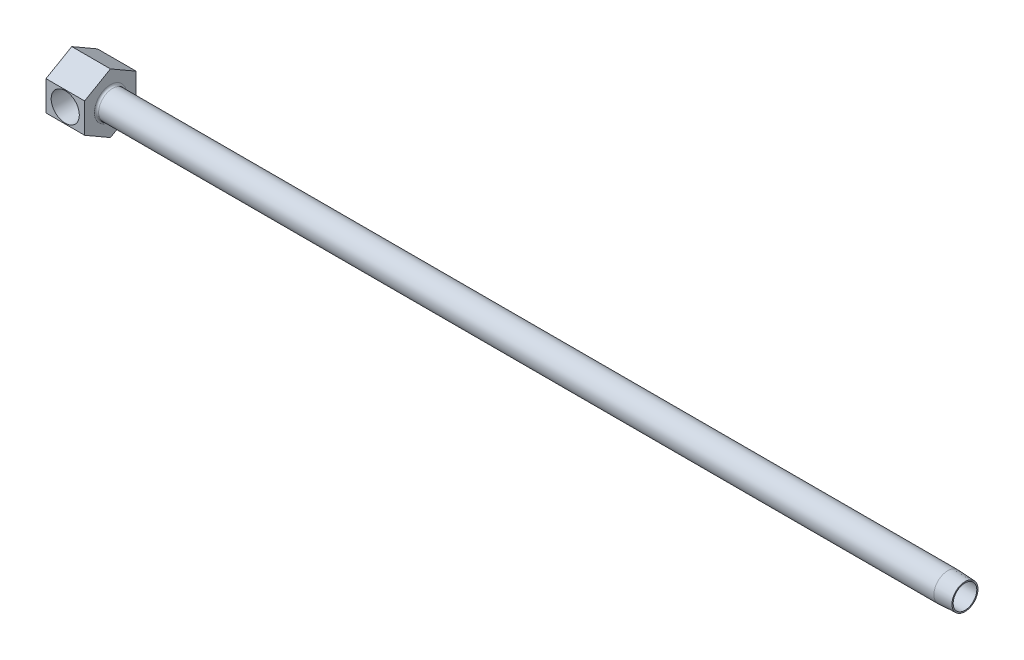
ISO-10303-21;
HEADER;
FILE_DESCRIPTION(('STEP AP214'),'2;1');
FILE_NAME('part.step','',(''),(''),'','','');
FILE_SCHEMA(('AUTOMOTIVE_DESIGN { 1 0 10303 214 1 1 1 1 }'));
ENDSEC;
DATA;
#1=APPLICATION_CONTEXT('core data for automotive mechanical design processes');
#2=APPLICATION_PROTOCOL_DEFINITION('international standard','automotive_design',2000,#1);
#3=PRODUCT_CONTEXT('',#1,'mechanical');
#4=PRODUCT('Part','Part','',(#3));
#5=PRODUCT_RELATED_PRODUCT_CATEGORY('part','',(#4));
#6=PRODUCT_DEFINITION_FORMATION('','',#4);
#7=PRODUCT_DEFINITION_CONTEXT('part definition',#1,'design');
#8=PRODUCT_DEFINITION('design','',#6,#7);
#9=PRODUCT_DEFINITION_SHAPE('','',#8);
#10=(LENGTH_UNIT() NAMED_UNIT(*) SI_UNIT(.MILLI.,.METRE.));
#11=(NAMED_UNIT(*) PLANE_ANGLE_UNIT() SI_UNIT($,.RADIAN.));
#12=(NAMED_UNIT(*) SI_UNIT($,.STERADIAN.) SOLID_ANGLE_UNIT());
#13=UNCERTAINTY_MEASURE_WITH_UNIT(LENGTH_MEASURE(1.E-05),#10,'distance_accuracy_value','');
#14=(GEOMETRIC_REPRESENTATION_CONTEXT(3) GLOBAL_UNCERTAINTY_ASSIGNED_CONTEXT((#13)) GLOBAL_UNIT_ASSIGNED_CONTEXT((#10,
#11,#12)) REPRESENTATION_CONTEXT('',''));
#15=CARTESIAN_POINT('',(0.,0.,0.));
#16=DIRECTION('',(0.,0.,1.));
#17=DIRECTION('',(1.,0.,0.));
#18=AXIS2_PLACEMENT_3D('',#15,#16,#17);
#19=CARTESIAN_POINT('',(7.14375,0.,9.525));
#20=DIRECTION('',(1.,0.,0.));
#21=DIRECTION('',(0.,0.,-1.));
#22=AXIS2_PLACEMENT_3D('',#19,#20,#21);
#23=PLANE('',#22);
#24=DIRECTION('',(0.,0.,1.));
#25=VECTOR('',#24,1.);
#26=CARTESIAN_POINT('',(7.14375,4.21628045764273,19.05));
#27=LINE('',#26,#25);
#28=CARTESIAN_POINT('',(7.14375,4.21628045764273,8.39289543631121));
#29=VERTEX_POINT('',#28);
#30=CARTESIAN_POINT('',(7.14375,4.21628045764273,10.16));
#31=VERTEX_POINT('',#30);
#32=EDGE_CURVE('E280',#29,#31,#27,.T.);
#33=ORIENTED_EDGE('',*,*,#32,.F.);
#34=CARTESIAN_POINT('',(7.14375,0.,9.525));
#35=DIRECTION('',(1.,0.,0.));
#36=DIRECTION('',(0.,0.,-1.));
#37=AXIS2_PLACEMENT_3D('',#34,#35,#36);
#38=CIRCLE('',#37,4.365625);
#39=CARTESIAN_POINT('',(7.14375,4.31919629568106,10.16));
#40=VERTEX_POINT('',#39);
#41=EDGE_CURVE('E163',#29,#40,#38,.T.);
#42=ORIENTED_EDGE('',*,*,#41,.T.);
#43=DIRECTION('',(0.,1.,0.));
#44=VECTOR('',#43,1.);
#45=CARTESIAN_POINT('',(7.14375,0.,10.16));
#46=LINE('',#45,#44);
#47=EDGE_CURVE('E153',#31,#40,#46,.T.);
#48=ORIENTED_EDGE('',*,*,#47,.F.);
#49=EDGE_LOOP('',(#33,#42,#48));
#50=FACE_BOUND('',#49,.T.);
#51=ADVANCED_FACE('F15',(#50),#23,.T.);
#52=CARTESIAN_POINT('',(14.2875,5.4992613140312,19.05));
#53=DIRECTION('',(0.,0.,-1.));
#54=DIRECTION('',(-1.,0.,0.));
#55=AXIS2_PLACEMENT_3D('',#52,#53,#54);
#56=PLANE('',#55);
#57=CARTESIAN_POINT('',(7.112,0.,19.05));
#58=DIRECTION('',(0.,0.,1.));
#59=DIRECTION('',(1.,0.,0.));
#60=AXIS2_PLACEMENT_3D('',#57,#58,#59);
#61=CIRCLE('',#60,5.2023645);
#62=CARTESIAN_POINT('',(12.3143645,0.,19.05));
#63=VERTEX_POINT('',#62);
#64=EDGE_CURVE('E269',#63,#63,#61,.T.);
#65=ORIENTED_EDGE('',*,*,#64,.F.);
#66=EDGE_LOOP('',(#65));
#67=FACE_BOUND('',#66,.T.);
#68=DIRECTION('',(0.,-1.,0.));
#69=VECTOR('',#68,1.);
#70=CARTESIAN_POINT('',(0.,5.4992613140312,19.05));
#71=LINE('',#70,#69);
#72=CARTESIAN_POINT('',(0.,5.4992613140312,19.05));
#73=VERTEX_POINT('',#72);
#74=CARTESIAN_POINT('',(0.,-5.49926131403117,19.05));
#75=VERTEX_POINT('',#74);
#76=EDGE_CURVE('E178',#73,#75,#71,.T.);
#77=ORIENTED_EDGE('',*,*,#76,.T.);
#78=DIRECTION('',(-1.,0.,0.));
#79=VECTOR('',#78,1.);
#80=CARTESIAN_POINT('',(14.2875,-5.49926131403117,19.05));
#81=LINE('',#80,#79);
#82=CARTESIAN_POINT('',(14.2875,-5.49926131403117,19.05));
#83=VERTEX_POINT('',#82);
#84=EDGE_CURVE('E201',#83,#75,#81,.T.);
#85=ORIENTED_EDGE('',*,*,#84,.F.);
#86=DIRECTION('',(0.,-1.,0.));
#87=VECTOR('',#86,1.);
#88=CARTESIAN_POINT('',(14.2875,5.4992613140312,19.05));
#89=LINE('',#88,#87);
#90=CARTESIAN_POINT('',(14.2875,5.4992613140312,19.05));
#91=VERTEX_POINT('',#90);
#92=EDGE_CURVE('E194',#91,#83,#89,.T.);
#93=ORIENTED_EDGE('',*,*,#92,.F.);
#94=DIRECTION('',(-1.,0.,0.));
#95=VECTOR('',#94,1.);
#96=CARTESIAN_POINT('',(14.2875,5.4992613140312,19.05));
#97=LINE('',#96,#95);
#98=EDGE_CURVE('E204',#91,#73,#97,.T.);
#99=ORIENTED_EDGE('',*,*,#98,.T.);
#100=EDGE_LOOP('',(#77,#85,#93,#99));
#101=FACE_BOUND('',#100,.T.);
#102=ADVANCED_FACE('F119',(#67,#101),#56,.F.);
#103=CARTESIAN_POINT('',(14.2875,-5.49926131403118,0.));
#104=DIRECTION('',(1.,0.,0.));
#105=DIRECTION('',(0.,1.,0.));
#106=AXIS2_PLACEMENT_3D('',#103,#104,#105);
#107=PLANE('',#106);
#108=CARTESIAN_POINT('',(14.2875,0.,9.525));
#109=DIRECTION('',(1.,0.,0.));
#110=DIRECTION('',(0.,1.,0.));
#111=AXIS2_PLACEMENT_3D('',#108,#109,#110);
#112=CIRCLE('',#111,5.9309);
#113=CARTESIAN_POINT('',(14.2875,5.9309,9.525));
#114=VERTEX_POINT('',#113);
#115=EDGE_CURVE('E216',#114,#114,#112,.F.);
#116=ORIENTED_EDGE('',*,*,#115,.T.);
#117=EDGE_LOOP('',(#116));
#118=FACE_BOUND('',#117,.T.);
#119=DIRECTION('',(0.,0.5,-0.866025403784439));
#120=VECTOR('',#119,1.);
#121=CARTESIAN_POINT('',(14.2875,-10.9985226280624,9.525));
#122=LINE('',#121,#120);
#123=CARTESIAN_POINT('',(14.2875,-10.9985226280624,9.525));
#124=VERTEX_POINT('',#123);
#125=CARTESIAN_POINT('',(14.2875,-5.49926131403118,0.));
#126=VERTEX_POINT('',#125);
#127=EDGE_CURVE('E184',#124,#126,#122,.T.);
#128=ORIENTED_EDGE('',*,*,#127,.T.);
#129=DIRECTION('',(0.,1.,0.));
#130=VECTOR('',#129,1.);
#131=CARTESIAN_POINT('',(14.2875,-5.49926131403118,0.));
#132=LINE('',#131,#130);
#133=CARTESIAN_POINT('',(14.2875,5.49926131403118,0.));
#134=VERTEX_POINT('',#133);
#135=EDGE_CURVE('E188',#126,#134,#132,.T.);
#136=ORIENTED_EDGE('',*,*,#135,.T.);
#137=DIRECTION('',(0.,0.5,0.866025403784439));
#138=VECTOR('',#137,1.);
#139=CARTESIAN_POINT('',(14.2875,5.49926131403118,0.));
#140=LINE('',#139,#138);
#141=CARTESIAN_POINT('',(14.2875,10.9985226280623,9.525));
#142=VERTEX_POINT('',#141);
#143=EDGE_CURVE('E190',#134,#142,#140,.T.);
#144=ORIENTED_EDGE('',*,*,#143,.T.);
#145=DIRECTION('',(0.,-0.5,0.86602540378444));
#146=VECTOR('',#145,1.);
#147=CARTESIAN_POINT('',(14.2875,10.9985226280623,9.525));
#148=LINE('',#147,#146);
#149=EDGE_CURVE('E192',#142,#91,#148,.T.);
#150=ORIENTED_EDGE('',*,*,#149,.T.);
#151=ORIENTED_EDGE('',*,*,#92,.T.);
#152=DIRECTION('',(0.,-0.5,-0.866025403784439));
#153=VECTOR('',#152,1.);
#154=CARTESIAN_POINT('',(14.2875,-5.49926131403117,19.05));
#155=LINE('',#154,#153);
#156=EDGE_CURVE('E38',#83,#124,#155,.T.);
#157=ORIENTED_EDGE('',*,*,#156,.T.);
#158=EDGE_LOOP('',(#128,#136,#144,#150,#151,#157));
#159=FACE_BOUND('',#158,.T.);
#160=ADVANCED_FACE('F127',(#118,#159),#107,.T.);
#161=CARTESIAN_POINT('',(14.2875,-10.9985226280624,9.525));
#162=DIRECTION('',(0.,0.866025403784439,0.5));
#163=DIRECTION('',(0.,-0.5,0.866025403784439));
#164=AXIS2_PLACEMENT_3D('',#161,#162,#163);
#165=PLANE('',#164);
#166=DIRECTION('',(0.,0.5,-0.866025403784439));
#167=VECTOR('',#166,1.);
#168=CARTESIAN_POINT('',(0.,-10.9985226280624,9.525));
#169=LINE('',#168,#167);
#170=CARTESIAN_POINT('',(0.,-10.9985226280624,9.525));
#171=VERTEX_POINT('',#170);
#172=CARTESIAN_POINT('',(0.,-5.49926131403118,0.));
#173=VERTEX_POINT('',#172);
#174=EDGE_CURVE('E166',#171,#173,#169,.T.);
#175=ORIENTED_EDGE('',*,*,#174,.T.);
#176=DIRECTION('',(-1.,0.,0.));
#177=VECTOR('',#176,1.);
#178=CARTESIAN_POINT('',(14.2875,-5.49926131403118,0.));
#179=LINE('',#178,#177);
#180=EDGE_CURVE('E213',#126,#173,#179,.T.);
#181=ORIENTED_EDGE('',*,*,#180,.F.);
#182=ORIENTED_EDGE('',*,*,#127,.F.);
#183=DIRECTION('',(-1.,0.,0.));
#184=VECTOR('',#183,1.);
#185=CARTESIAN_POINT('',(14.2875,-10.9985226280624,9.525));
#186=LINE('',#185,#184);
#187=EDGE_CURVE('E197',#124,#171,#186,.T.);
#188=ORIENTED_EDGE('',*,*,#187,.T.);
#189=EDGE_LOOP('',(#175,#181,#182,#188));
#190=FACE_BOUND('',#189,.T.);
#191=ADVANCED_FACE('F301',(#190),#165,.F.);
#192=CARTESIAN_POINT('',(14.2875,-5.49926131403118,0.));
#193=DIRECTION('',(0.,0.,1.));
#194=DIRECTION('',(0.,-1.,0.));
#195=AXIS2_PLACEMENT_3D('',#192,#193,#194);
#196=PLANE('',#195);
#197=DIRECTION('',(0.,1.,0.));
#198=VECTOR('',#197,1.);
#199=CARTESIAN_POINT('',(0.,-5.49926131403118,0.));
#200=LINE('',#199,#198);
#201=CARTESIAN_POINT('',(0.,5.49926131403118,0.));
#202=VERTEX_POINT('',#201);
#203=EDGE_CURVE('E169',#173,#202,#200,.T.);
#204=ORIENTED_EDGE('',*,*,#203,.T.);
#205=DIRECTION('',(-1.,0.,0.));
#206=VECTOR('',#205,1.);
#207=CARTESIAN_POINT('',(14.2875,5.49926131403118,0.));
#208=LINE('',#207,#206);
#209=EDGE_CURVE('E210',#134,#202,#208,.T.);
#210=ORIENTED_EDGE('',*,*,#209,.F.);
#211=ORIENTED_EDGE('',*,*,#135,.F.);
#212=ORIENTED_EDGE('',*,*,#180,.T.);
#213=EDGE_LOOP('',(#204,#210,#211,#212));
#214=FACE_BOUND('',#213,.T.);
#215=ADVANCED_FACE('F307',(#214),#196,.F.);
#216=CARTESIAN_POINT('',(14.2875,5.49926131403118,0.));
#217=DIRECTION('',(0.,-0.866025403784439,0.5));
#218=DIRECTION('',(0.,-0.5,-0.866025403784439));
#219=AXIS2_PLACEMENT_3D('',#216,#217,#218);
#220=PLANE('',#219);
#221=DIRECTION('',(0.,0.5,0.866025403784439));
#222=VECTOR('',#221,1.);
#223=CARTESIAN_POINT('',(0.,5.49926131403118,0.));
#224=LINE('',#223,#222);
#225=CARTESIAN_POINT('',(0.,10.9985226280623,9.525));
#226=VERTEX_POINT('',#225);
#227=EDGE_CURVE('E172',#202,#226,#224,.T.);
#228=ORIENTED_EDGE('',*,*,#227,.T.);
#229=DIRECTION('',(-1.,0.,0.));
#230=VECTOR('',#229,1.);
#231=CARTESIAN_POINT('',(14.2875,10.9985226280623,9.525));
#232=LINE('',#231,#230);
#233=EDGE_CURVE('E207',#142,#226,#232,.T.);
#234=ORIENTED_EDGE('',*,*,#233,.F.);
#235=ORIENTED_EDGE('',*,*,#143,.F.);
#236=ORIENTED_EDGE('',*,*,#209,.T.);
#237=EDGE_LOOP('',(#228,#234,#235,#236));
#238=FACE_BOUND('',#237,.T.);
#239=ADVANCED_FACE('F309',(#238),#220,.F.);
#240=CARTESIAN_POINT('',(14.2875,10.9985226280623,9.525));
#241=DIRECTION('',(0.,-0.86602540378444,-0.5));
#242=DIRECTION('',(0.,0.5,-0.86602540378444));
#243=AXIS2_PLACEMENT_3D('',#240,#241,#242);
#244=PLANE('',#243);
#245=DIRECTION('',(0.,-0.5,0.86602540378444));
#246=VECTOR('',#245,1.);
#247=CARTESIAN_POINT('',(0.,10.9985226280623,9.525));
#248=LINE('',#247,#246);
#249=EDGE_CURVE('E175',#226,#73,#248,.T.);
#250=ORIENTED_EDGE('',*,*,#249,.T.);
#251=ORIENTED_EDGE('',*,*,#98,.F.);
#252=ORIENTED_EDGE('',*,*,#149,.F.);
#253=ORIENTED_EDGE('',*,*,#233,.T.);
#254=EDGE_LOOP('',(#250,#251,#252,#253));
#255=FACE_BOUND('',#254,.T.);
#256=ADVANCED_FACE('F312',(#255),#244,.F.);
#257=CARTESIAN_POINT('',(14.2875,-5.49926131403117,19.05));
#258=DIRECTION('',(0.,0.866025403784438,-0.5));
#259=DIRECTION('',(0.,0.5,0.866025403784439));
#260=AXIS2_PLACEMENT_3D('',#257,#258,#259);
#261=PLANE('',#260);
#262=DIRECTION('',(0.,-0.5,-0.866025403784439));
#263=VECTOR('',#262,1.);
#264=CARTESIAN_POINT('',(0.,-5.49926131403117,19.05));
#265=LINE('',#264,#263);
#266=EDGE_CURVE('E181',#75,#171,#265,.T.);
#267=ORIENTED_EDGE('',*,*,#266,.T.);
#268=ORIENTED_EDGE('',*,*,#187,.F.);
#269=ORIENTED_EDGE('',*,*,#156,.F.);
#270=ORIENTED_EDGE('',*,*,#84,.T.);
#271=EDGE_LOOP('',(#267,#268,#269,#270));
#272=FACE_BOUND('',#271,.T.);
#273=ADVANCED_FACE('F296',(#272),#261,.F.);
#274=CARTESIAN_POINT('',(0.,-5.49926131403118,0.));
#275=DIRECTION('',(1.,0.,0.));
#276=DIRECTION('',(0.,1.,0.));
#277=AXIS2_PLACEMENT_3D('',#274,#275,#276);
#278=PLANE('',#277);
#279=ORIENTED_EDGE('',*,*,#174,.F.);
#280=ORIENTED_EDGE('',*,*,#266,.F.);
#281=ORIENTED_EDGE('',*,*,#76,.F.);
#282=ORIENTED_EDGE('',*,*,#249,.F.);
#283=ORIENTED_EDGE('',*,*,#227,.F.);
#284=ORIENTED_EDGE('',*,*,#203,.F.);
#285=EDGE_LOOP('',(#279,#280,#281,#282,#283,#284));
#286=FACE_BOUND('',#285,.T.);
#287=ADVANCED_FACE('F141',(#286),#278,.F.);
#288=CARTESIAN_POINT('',(68.0114010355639,0.,9.525));
#289=DIRECTION('',(-1.,0.,0.));
#290=DIRECTION('',(0.,0.,1.));
#291=AXIS2_PLACEMENT_3D('',#288,#289,#290);
#292=CYLINDRICAL_SURFACE('',#291,5.1435);
#293=CARTESIAN_POINT('',(323.85,0.,9.525));
#294=DIRECTION('',(-1.,0.,0.));
#295=DIRECTION('',(0.,0.,1.));
#296=AXIS2_PLACEMENT_3D('',#293,#294,#295);
#297=CIRCLE('',#296,5.1435);
#298=CARTESIAN_POINT('',(323.85,0.,14.6685));
#299=VERTEX_POINT('',#298);
#300=EDGE_CURVE('E10',#299,#299,#297,.F.);
#301=ORIENTED_EDGE('',*,*,#300,.F.);
#302=EDGE_LOOP('',(#301));
#303=FACE_BOUND('',#302,.T.);
#304=CARTESIAN_POINT('',(15.0749,0.,9.525));
#305=DIRECTION('',(1.,0.,0.));
#306=DIRECTION('',(0.,1.,0.));
#307=AXIS2_PLACEMENT_3D('',#304,#305,#306);
#308=CIRCLE('',#307,5.1435);
#309=CARTESIAN_POINT('',(15.0749,5.1435,9.525));
#310=VERTEX_POINT('',#309);
#311=EDGE_CURVE('E219',#310,#310,#308,.T.);
#312=ORIENTED_EDGE('',*,*,#311,.T.);
#313=EDGE_LOOP('',(#312));
#314=FACE_BOUND('',#313,.T.);
#315=ADVANCED_FACE('F17',(#303,#314),#292,.T.);
#316=CARTESIAN_POINT('',(7.14375,-4.31919629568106,10.16));
#317=VERTEX_POINT('',#316);
#318=CARTESIAN_POINT('',(7.14375,-4.21628045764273,10.16));
#319=VERTEX_POINT('',#318);
#320=EDGE_CURVE('E146',#317,#319,#46,.T.);
#321=ORIENTED_EDGE('',*,*,#320,.F.);
#322=CARTESIAN_POINT('',(7.14375,-4.21628045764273,8.39289543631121));
#323=VERTEX_POINT('',#322);
#324=EDGE_CURVE('E148',#317,#323,#38,.T.);
#325=ORIENTED_EDGE('',*,*,#324,.T.);
#326=DIRECTION('',(0.,0.,1.));
#327=VECTOR('',#326,1.);
#328=CARTESIAN_POINT('',(7.14375,-4.21628045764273,19.05));
#329=LINE('',#328,#327);
#330=EDGE_CURVE('E149',#319,#323,#329,.F.);
#331=ORIENTED_EDGE('',*,*,#330,.F.);
#332=EDGE_LOOP('',(#321,#325,#331));
#333=FACE_BOUND('',#332,.T.);
#334=ADVANCED_FACE('F122',(#333),#23,.T.);
#335=CARTESIAN_POINT('',(66.1375087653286,0.,9.525));
#336=DIRECTION('',(1.,0.,0.));
#337=DIRECTION('',(0.,0.,-1.));
#338=AXIS2_PLACEMENT_3D('',#335,#336,#337);
#339=CYLINDRICAL_SURFACE('',#338,4.365625);
#340=DIRECTION('',(1.,0.,0.));
#341=VECTOR('',#340,1.);
#342=CARTESIAN_POINT('',(66.1375087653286,4.31919629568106,10.16));
#343=LINE('',#342,#341);
#344=CARTESIAN_POINT('',(9.50166012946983,4.31919629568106,10.16));
#345=VERTEX_POINT('',#344);
#346=EDGE_CURVE('E23',#40,#345,#343,.T.);
#347=ORIENTED_EDGE('',*,*,#346,.F.);
#348=ORIENTED_EDGE('',*,*,#41,.F.);
#349=CARTESIAN_POINT('',(11.0152606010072,1.5945487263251,5.461));
#350=CARTESIAN_POINT('',(10.9690910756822,1.7075595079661,5.50534166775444));
#351=CARTESIAN_POINT('',(10.9186455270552,1.81703423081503,5.55373339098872));
#352=CARTESIAN_POINT('',(10.810302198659,2.02846645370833,5.65746242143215));
#353=CARTESIAN_POINT('',(10.7524192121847,2.13043826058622,5.71278593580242));
#354=CARTESIAN_POINT('',(10.5698905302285,2.42358040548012,5.88682744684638));
#355=CARTESIAN_POINT('',(10.4356317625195,2.6037024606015,6.01432367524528));
#356=CARTESIAN_POINT('',(10.2004726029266,2.87382153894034,6.2358690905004));
#357=CARTESIAN_POINT('',(10.1051285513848,2.97281573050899,6.32528321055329));
#358=CARTESIAN_POINT('',(9.90783434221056,3.15907014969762,6.50903483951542));
#359=CARTESIAN_POINT('',(9.80588273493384,3.2463277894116,6.60337342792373));
#360=CARTESIAN_POINT('',(9.59613587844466,3.40951469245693,6.79556583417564));
#361=CARTESIAN_POINT('',(9.48833347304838,3.48542963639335,6.89342390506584));
#362=CARTESIAN_POINT('',(9.26745878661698,3.62617881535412,7.09103053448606));
#363=CARTESIAN_POINT('',(9.15438825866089,3.69101670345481,7.19077845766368));
#364=CARTESIAN_POINT('',(8.91700112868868,3.81296593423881,7.39547820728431));
#365=CARTESIAN_POINT('',(8.79240497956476,3.86952009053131,7.50043788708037));
#366=CARTESIAN_POINT('',(8.53587575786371,3.97111492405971,7.70779573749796));
#367=CARTESIAN_POINT('',(8.40392330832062,4.01612325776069,7.81018600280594));
#368=CARTESIAN_POINT('',(8.16304729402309,4.0847277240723,7.98226690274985));
#369=CARTESIAN_POINT('',(8.0562781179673,4.11086974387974,8.05387458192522));
#370=CARTESIAN_POINT('',(7.89027521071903,4.14432560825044,8.15224503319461));
#371=CARTESIAN_POINT('',(7.83425575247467,4.15448196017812,8.18339689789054));
#372=CARTESIAN_POINT('',(7.71975817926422,4.17277321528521,8.24142733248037));
#373=CARTESIAN_POINT('',(7.6612817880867,4.18090950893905,8.26830883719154));
#374=CARTESIAN_POINT('',(7.52931857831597,4.19631734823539,8.32062856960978));
#375=CARTESIAN_POINT('',(7.45518069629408,4.2030846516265,8.34468558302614));
#376=CARTESIAN_POINT('',(7.30234246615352,4.21282137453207,8.37996487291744));
#377=CARTESIAN_POINT('',(7.22358315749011,4.21571837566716,8.39094201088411));
#378=CARTESIAN_POINT('',(7.14374999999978,4.21628045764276,8.39289543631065));
#379=B_SPLINE_CURVE_WITH_KNOTS('',3,(#349,#350,#351,#352,#353,#354,#355,#356,#357,#358,#359,
#360,#361,#362,#363,#364,#365,#366,#367,#368,#369,#370,#371,#372,#373,#374,#375,#376,#377,#378),
.UNSPECIFIED.,.F.,.F.,(4,2,2,2,2,2,2,2,2,2,2,2,2,2,4),(0.,0.389178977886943,0.777595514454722,
1.54850925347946,2.03989074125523,2.5313804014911,3.02348538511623,3.51542776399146,
4.03226982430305,4.5505442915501,4.94339994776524,5.13792303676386,5.33231185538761,
5.56585330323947,5.80370611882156),.UNSPECIFIED.);
#380=CARTESIAN_POINT('',(11.0152606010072,1.5945487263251,5.461));
#381=VERTEX_POINT('',#380);
#382=EDGE_CURVE('E222',#381,#29,#379,.T.);
#383=ORIENTED_EDGE('',*,*,#382,.F.);
#384=CARTESIAN_POINT('',(11.038608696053,-1.66986531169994,5.4913625));
#385=CARTESIAN_POINT('',(11.0105354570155,-1.5831922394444,5.45544731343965));
#386=CARTESIAN_POINT('',(10.985979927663,-1.49442111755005,5.422003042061));
#387=CARTESIAN_POINT('',(10.9431209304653,-1.31365154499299,5.36062405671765));
#388=CARTESIAN_POINT('',(10.9248095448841,-1.22165734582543,5.3326823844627));
#389=CARTESIAN_POINT('',(10.8936059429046,-1.03529168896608,5.28281066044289));
#390=CARTESIAN_POINT('',(10.8807075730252,-0.94092306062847,5.26087379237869));
#391=CARTESIAN_POINT('',(10.8594086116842,-0.750424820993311,5.22325970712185));
#392=CARTESIAN_POINT('',(10.8510094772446,-0.654294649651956,5.20758451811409));
#393=CARTESIAN_POINT('',(10.8381415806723,-0.463156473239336,5.18296779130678));
#394=CARTESIAN_POINT('',(10.8335877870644,-0.368172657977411,5.1738812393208));
#395=CARTESIAN_POINT('',(10.8276558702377,-0.177678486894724,5.16194794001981));
#396=CARTESIAN_POINT('',(10.8262790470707,-0.0821679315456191,5.15910374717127));
#397=CARTESIAN_POINT('',(10.826564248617,0.108822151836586,5.15968693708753));
#398=CARTESIAN_POINT('',(10.828226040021,0.204301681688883,5.16311383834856));
#399=CARTESIAN_POINT('',(10.8347557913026,0.3946850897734,5.17620642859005));
#400=CARTESIAN_POINT('',(10.8396224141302,0.489589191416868,5.18586951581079));
#401=CARTESIAN_POINT('',(10.8530224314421,0.678329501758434,5.2113452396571));
#402=CARTESIAN_POINT('',(10.861556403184,0.772165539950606,5.22715884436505));
#403=CARTESIAN_POINT('',(10.882977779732,0.958108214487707,5.26475262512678));
#404=CARTESIAN_POINT('',(10.8958637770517,1.05021539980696,5.28653087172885));
#405=CARTESIAN_POINT('',(10.9268394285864,1.23213175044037,5.33579934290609));
#406=CARTESIAN_POINT('',(10.9449350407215,1.32193815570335,5.36329609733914));
#407=CARTESIAN_POINT('',(10.9870994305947,1.49845562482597,5.42352620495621));
#408=CARTESIAN_POINT('',(11.0111754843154,1.58516276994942,5.45626591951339));
#409=CARTESIAN_POINT('',(11.038608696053,1.66986531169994,5.4913625));
#410=B_SPLINE_CURVE_WITH_KNOTS('',3,(#384,#385,#386,#387,#388,#389,#390,#391,#392,#393,#394,
#395,#396,#397,#398,#399,#400,#401,#402,#403,#404,#405,#406,#407,#408,#409),.UNSPECIFIED.,.F.,
.F.,(4,2,2,2,2,2,2,2,2,2,2,2,4),(0.,0.293591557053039,0.586809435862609,0.879693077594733,
1.17267150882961,1.45898777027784,1.74542117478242,2.03183258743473,2.31812458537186,
2.60446166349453,2.89070622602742,3.17727945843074,3.46420306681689),.UNSPECIFIED.);
#411=CARTESIAN_POINT('',(11.0152606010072,-1.5945487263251,5.461));
#412=VERTEX_POINT('',#411);
#413=EDGE_CURVE('E227',#412,#381,#410,.T.);
#414=ORIENTED_EDGE('',*,*,#413,.F.);
#415=CARTESIAN_POINT('',(7.14375,-4.21628045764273,8.39289543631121));
#416=CARTESIAN_POINT('',(7.18362399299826,-4.21598583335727,8.39181806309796));
#417=CARTESIAN_POINT('',(7.22338201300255,-4.21511517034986,8.38855660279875));
#418=CARTESIAN_POINT('',(7.30220974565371,-4.21229002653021,8.3781194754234));
#419=CARTESIAN_POINT('',(7.34128135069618,-4.21033927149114,8.37095726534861));
#420=CARTESIAN_POINT('',(7.45558593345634,-4.20306181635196,8.34463096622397));
#421=CARTESIAN_POINT('',(7.52959005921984,-4.19629141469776,8.32054287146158));
#422=CARTESIAN_POINT('',(7.67793141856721,-4.17895935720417,8.2616842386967));
#423=CARTESIAN_POINT('',(7.75200183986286,-4.16818767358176,8.22634138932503));
#424=CARTESIAN_POINT('',(7.89635080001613,-4.14345087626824,8.14945009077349));
#425=CARTESIAN_POINT('',(7.96662283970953,-4.12948049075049,8.10789143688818));
#426=CARTESIAN_POINT('',(8.10525974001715,-4.09836535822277,8.02024615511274));
#427=CARTESIAN_POINT('',(8.17357097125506,-4.08117012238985,7.97409391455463));
#428=CARTESIAN_POINT('',(8.30769836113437,-4.04390532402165,7.87936489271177));
#429=CARTESIAN_POINT('',(8.37351346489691,-4.02383456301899,7.83078710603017));
#430=CARTESIAN_POINT('',(8.57859672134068,-3.95588469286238,7.67482924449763));
#431=CARTESIAN_POINT('',(8.71418056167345,-3.90283307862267,7.56482866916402));
#432=CARTESIAN_POINT('',(8.97841531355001,-3.78358080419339,7.34346052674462));
#433=CARTESIAN_POINT('',(9.10705932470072,-3.71736735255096,7.23209172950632));
#434=CARTESIAN_POINT('',(9.35705912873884,-3.57190642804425,7.01153592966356));
#435=CARTESIAN_POINT('',(9.47845600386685,-3.49274436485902,6.90233956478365));
#436=CARTESIAN_POINT('',(9.71438396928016,-3.32067953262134,6.68762551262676));
#437=CARTESIAN_POINT('',(9.82891987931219,-3.22778657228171,6.58210526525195));
#438=CARTESIAN_POINT('',(10.0969445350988,-2.98549279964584,6.33327532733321));
#439=CARTESIAN_POINT('',(10.2465325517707,-2.82876640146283,6.19275827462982));
#440=CARTESIAN_POINT('',(10.5251240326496,-2.48539491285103,5.92944140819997));
#441=CARTESIAN_POINT('',(10.6541872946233,-2.29884003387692,5.80659022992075));
#442=CARTESIAN_POINT('',(10.815064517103,-2.01834728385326,5.65289947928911));
#443=CARTESIAN_POINT('',(10.8584525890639,-1.93670806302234,5.61137999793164));
#444=CARTESIAN_POINT('',(10.9405236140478,-1.76894321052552,5.53274400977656));
#445=CARTESIAN_POINT('',(10.9792015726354,-1.6828129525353,5.49563217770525));
#446=CARTESIAN_POINT('',(11.0152606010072,-1.5945487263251,5.461));
#447=B_SPLINE_CURVE_WITH_KNOTS('',3,(#415,#416,#417,#418,#419,#420,#421,#422,#423,#424,#425,
#426,#427,#428,#429,#430,#431,#432,#433,#434,#435,#436,#437,#438,#439,#440,#441,#442,#443,#444,
#445,#446),.UNSPECIFIED.,.F.,.F.,(4,2,2,2,2,2,2,2,2,2,2,2,2,2,2,4),(0.,0.119524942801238,
0.238640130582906,0.471907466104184,0.719716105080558,0.967936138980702,1.2204276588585,
1.47302472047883,2.01967972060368,2.56686861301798,3.1105838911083,3.65391262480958,
4.4259772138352,5.19574951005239,5.49953103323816,5.80363192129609),.UNSPECIFIED.);
#448=EDGE_CURVE('E162',#323,#412,#447,.T.);
#449=ORIENTED_EDGE('',*,*,#448,.F.);
#450=ORIENTED_EDGE('',*,*,#324,.F.);
#451=DIRECTION('',(1.,0.,0.));
#452=VECTOR('',#451,1.);
#453=CARTESIAN_POINT('',(66.1375087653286,-4.31919629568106,10.16));
#454=LINE('',#453,#452);
#455=CARTESIAN_POINT('',(9.50166012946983,-4.31919629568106,10.16));
#456=VERTEX_POINT('',#455);
#457=EDGE_CURVE('E160',#456,#317,#454,.F.);
#458=ORIENTED_EDGE('',*,*,#457,.F.);
#459=CARTESIAN_POINT('',(9.50159462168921,4.31922569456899,10.1598));
#460=CARTESIAN_POINT('',(9.52205476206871,4.31004461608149,10.2222542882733));
#461=CARTESIAN_POINT('',(9.54440879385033,4.29961032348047,10.2838517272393));
#462=CARTESIAN_POINT('',(9.592244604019,4.27639816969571,10.4052958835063));
#463=CARTESIAN_POINT('',(9.61772301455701,4.26362282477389,10.4651444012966));
#464=CARTESIAN_POINT('',(9.6977084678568,4.22211002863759,10.641720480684));
#465=CARTESIAN_POINT('',(9.75594525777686,4.19010742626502,10.7559937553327));
#466=CARTESIAN_POINT('',(9.87844694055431,4.11827910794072,10.9783012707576));
#467=CARTESIAN_POINT('',(9.94270165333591,4.07846648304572,11.0863455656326));
#468=CARTESIAN_POINT('',(10.0748723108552,3.9913538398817,11.2972300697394));
#469=CARTESIAN_POINT('',(10.1427929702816,3.94404402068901,11.4000632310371));
#470=CARTESIAN_POINT('',(10.298774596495,3.82856370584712,11.6276502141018));
#471=CARTESIAN_POINT('',(10.3873705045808,3.75819622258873,11.7509249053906));
#472=CARTESIAN_POINT('',(10.5646676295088,3.60591330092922,11.9899830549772));
#473=CARTESIAN_POINT('',(10.6533688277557,3.52399966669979,12.1057676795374));
#474=CARTESIAN_POINT('',(10.828903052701,3.34837324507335,12.3298815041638));
#475=CARTESIAN_POINT('',(10.9157338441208,3.25464716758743,12.4382020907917));
#476=CARTESIAN_POINT('',(11.0854790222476,3.05533823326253,12.6465978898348));
#477=CARTESIAN_POINT('',(11.1683947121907,2.94975936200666,12.746675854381));
#478=CARTESIAN_POINT('',(11.3637298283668,2.67738871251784,12.9797077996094));
#479=CARTESIAN_POINT('',(11.4730979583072,2.50408908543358,13.1077769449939));
#480=CARTESIAN_POINT('',(11.6736784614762,2.13317678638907,13.3402290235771));
#481=CARTESIAN_POINT('',(11.764930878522,1.93561933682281,13.444664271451));
#482=CARTESIAN_POINT('',(11.9092563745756,1.55445058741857,13.608817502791));
#483=CARTESIAN_POINT('',(11.9662034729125,1.37434002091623,13.6731460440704));
#484=CARTESIAN_POINT('',(12.036275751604,1.09545803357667,13.7520594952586));
#485=CARTESIAN_POINT('',(12.0570798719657,1.00100886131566,13.7754393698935));
#486=CARTESIAN_POINT('',(12.093196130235,0.80976989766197,13.8159777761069));
#487=CARTESIAN_POINT('',(12.1085105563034,0.712981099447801,13.8331388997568));
#488=CARTESIAN_POINT('',(12.1334016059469,0.517219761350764,13.861011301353));
#489=CARTESIAN_POINT('',(12.1429475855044,0.418238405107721,13.8716881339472));
#490=CARTESIAN_POINT('',(12.1559671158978,0.219418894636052,13.8862461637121));
#491=CARTESIAN_POINT('',(12.159443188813,0.119581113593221,13.8901301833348));
#492=CARTESIAN_POINT('',(12.1602489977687,-0.0801622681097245,13.8910308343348));
#493=CARTESIAN_POINT('',(12.157578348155,-0.180067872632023,13.8880470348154));
#494=CARTESIAN_POINT('',(12.1461610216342,-0.379063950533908,13.87528173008));
#495=CARTESIAN_POINT('',(12.1374146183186,-0.478154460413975,13.8655005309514));
#496=CARTESIAN_POINT('',(12.1041501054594,-0.757548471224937,13.8282625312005));
#497=CARTESIAN_POINT('',(12.0725539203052,-0.936048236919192,13.7928583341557));
#498=CARTESIAN_POINT('',(11.9914510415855,-1.28332325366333,13.701614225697));
#499=CARTESIAN_POINT('',(11.9419389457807,-1.45209555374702,13.645768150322));
#500=CARTESIAN_POINT('',(11.8234161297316,-1.78986703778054,13.5113020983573));
#501=CARTESIAN_POINT('',(11.7531886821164,-1.95786359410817,13.4312490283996));
#502=CARTESIAN_POINT('',(11.5990616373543,-2.2774775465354,13.2539727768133));
#503=CARTESIAN_POINT('',(11.515160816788,-2.42909347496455,13.1567480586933));
#504=CARTESIAN_POINT('',(11.2893838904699,-2.79222476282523,12.8919364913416));
#505=CARTESIAN_POINT('',(11.1405152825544,-2.99235864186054,12.7145443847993));
#506=CARTESIAN_POINT('',(10.9077049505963,-3.26312100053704,12.4281267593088));
#507=CARTESIAN_POINT('',(10.8282461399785,-3.34869576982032,12.3289140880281));
#508=CARTESIAN_POINT('',(10.6676325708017,-3.51003537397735,12.1240974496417));
#509=CARTESIAN_POINT('',(10.5864785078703,-3.58580414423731,12.0184960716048));
#510=CARTESIAN_POINT('',(10.4220303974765,-3.72941202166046,11.798300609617));
#511=CARTESIAN_POINT('',(10.338734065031,-3.79700254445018,11.6835467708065));
#512=CARTESIAN_POINT('',(10.1740816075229,-3.92201333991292,11.4470806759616));
#513=CARTESIAN_POINT('',(10.092727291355,-3.97942442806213,11.3253622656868));
#514=CARTESIAN_POINT('',(9.93568225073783,-4.08324264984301,11.0754774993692));
#515=CARTESIAN_POINT('',(9.85994825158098,-4.12974154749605,10.9473767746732));
#516=CARTESIAN_POINT('',(9.71779756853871,-4.21155620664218,10.6828322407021));
#517=CARTESIAN_POINT('',(9.65135922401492,-4.24689821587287,10.5464089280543));
#518=CARTESIAN_POINT('',(9.57628126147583,-4.28419371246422,10.3652627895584));
#519=CARTESIAN_POINT('',(9.56028735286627,-4.29194911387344,10.3247361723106));
#520=CARTESIAN_POINT('',(9.52977406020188,-4.30640007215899,10.2428664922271));
#521=CARTESIAN_POINT('',(9.51525722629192,-4.31309380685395,10.2015221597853));
#522=CARTESIAN_POINT('',(9.50159462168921,-4.31922569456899,10.1598));
#523=B_SPLINE_CURVE_WITH_KNOTS('',3,(#459,#460,#461,#462,#463,#464,#465,#466,#467,#468,#469,
#470,#471,#472,#473,#474,#475,#476,#477,#478,#479,#480,#481,#482,#483,#484,#485,#486,#487,#488,
#489,#490,#491,#492,#493,#494,#495,#496,#497,#498,#499,#500,#501,#502,#503,#504,#505,#506,#507,
#508,#509,#510,#511,#512,#513,#514,#515,#516,#517,#518,#519,#520,#521,#522),.UNSPECIFIED.,.F.,
.F.,(4,2,2,2,2,2,2,2,2,2,2,2,2,2,2,2,2,2,2,2,2,2,2,2,2,2,2,2,2,2,2,4),(0.,0.19895577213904,
0.397698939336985,0.793542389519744,1.1887279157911,1.58443438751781,2.08580736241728,
2.58710208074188,3.08896592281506,3.5906615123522,4.3128774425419,5.03347872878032,
5.62940645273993,5.92758657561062,6.22564226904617,6.52526772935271,6.82476866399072,
7.12428839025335,7.4237946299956,7.97525228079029,8.52687635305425,9.12138980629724,
9.71595648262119,10.6287987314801,11.0881817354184,11.5473798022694,12.018174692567,
12.4893922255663,12.9564924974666,13.4224855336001,13.5552077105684,13.6881552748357),.UNSPECIFIED.);
#524=EDGE_CURVE('E241',#345,#456,#523,.T.);
#525=ORIENTED_EDGE('',*,*,#524,.F.);
#526=EDGE_LOOP('',(#347,#348,#383,#414,#449,#450,#458,#525));
#527=FACE_BOUND('',#526,.T.);
#528=CARTESIAN_POINT('',(330.2,0.,9.525));
#529=DIRECTION('',(1.,0.,0.));
#530=DIRECTION('',(0.,0.,-1.));
#531=AXIS2_PLACEMENT_3D('',#528,#529,#530);
#532=CIRCLE('',#531,4.365625);
#533=CARTESIAN_POINT('',(330.2,0.,5.159375));
#534=VERTEX_POINT('',#533);
#535=EDGE_CURVE('E267',#534,#534,#532,.T.);
#536=ORIENTED_EDGE('',*,*,#535,.T.);
#537=EDGE_LOOP('',(#536));
#538=FACE_BOUND('',#537,.T.);
#539=ADVANCED_FACE('F114',(#527,#538),#339,.F.);
#540=CARTESIAN_POINT('',(15.0749,0.,9.525));
#541=DIRECTION('',(1.,0.,0.));
#542=DIRECTION('',(0.,1.,0.));
#543=AXIS2_PLACEMENT_3D('',#540,#541,#542);
#544=TOROIDAL_SURFACE('',#543,5.9309,0.7874);
#545=ORIENTED_EDGE('',*,*,#311,.F.);
#546=EDGE_LOOP('',(#545));
#547=FACE_BOUND('',#546,.T.);
#548=ORIENTED_EDGE('',*,*,#115,.F.);
#549=EDGE_LOOP('',(#548));
#550=FACE_BOUND('',#549,.T.);
#551=ADVANCED_FACE('F103',(#547,#550),#544,.F.);
#552=CARTESIAN_POINT('',(7.112,0.,5.461));
#553=DIRECTION('',(0.,0.,1.));
#554=DIRECTION('',(1.,0.,0.));
#555=AXIS2_PLACEMENT_3D('',#552,#553,#554);
#556=CONICAL_SURFACE('',#555,4.2164,1.02974425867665);
#557=ORIENTED_EDGE('',*,*,#413,.T.);
#558=CARTESIAN_POINT('',(7.112,0.,5.461));
#559=DIRECTION('',(0.,0.,1.));
#560=DIRECTION('',(1.,0.,0.));
#561=AXIS2_PLACEMENT_3D('',#558,#559,#560);
#562=CIRCLE('',#561,4.2164);
#563=EDGE_CURVE('E30',#381,#412,#562,.T.);
#564=ORIENTED_EDGE('',*,*,#563,.T.);
#565=EDGE_LOOP('',(#557,#564));
#566=FACE_BOUND('',#565,.T.);
#567=CARTESIAN_POINT('',(7.112,0.,2.92753128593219));
#568=VERTEX_POINT('',#567);
#569=VERTEX_LOOP('',#568);
#570=FACE_BOUND('',#569,.T.);
#571=ADVANCED_FACE('F100',(#566,#570),#556,.F.);
#572=CARTESIAN_POINT('',(7.112,0.,19.05));
#573=DIRECTION('',(0.,0.,1.));
#574=DIRECTION('',(1.,0.,0.));
#575=AXIS2_PLACEMENT_3D('',#572,#573,#574);
#576=CYLINDRICAL_SURFACE('',#575,4.2164);
#577=ORIENTED_EDGE('',*,*,#330,.T.);
#578=ORIENTED_EDGE('',*,*,#448,.T.);
#579=ORIENTED_EDGE('',*,*,#563,.F.);
#580=ORIENTED_EDGE('',*,*,#382,.T.);
#581=ORIENTED_EDGE('',*,*,#32,.T.);
#582=CARTESIAN_POINT('',(7.112,0.,10.16));
#583=DIRECTION('',(0.,0.,1.));
#584=DIRECTION('',(1.,0.,0.));
#585=AXIS2_PLACEMENT_3D('',#582,#583,#584);
#586=CIRCLE('',#585,4.2164);
#587=EDGE_CURVE('E277',#31,#319,#586,.T.);
#588=ORIENTED_EDGE('',*,*,#587,.T.);
#589=EDGE_LOOP('',(#577,#578,#579,#580,#581,#588));
#590=FACE_BOUND('',#589,.T.);
#591=ADVANCED_FACE('F102',(#590),#576,.F.);
#592=CARTESIAN_POINT('',(11.3284,0.,10.16));
#593=DIRECTION('',(0.,0.,-1.));
#594=DIRECTION('',(-1.,0.,0.));
#595=AXIS2_PLACEMENT_3D('',#592,#593,#594);
#596=PLANE('',#595);
#597=ORIENTED_EDGE('',*,*,#47,.T.);
#598=ORIENTED_EDGE('',*,*,#346,.T.);
#599=CARTESIAN_POINT('',(7.112,0.,10.16));
#600=DIRECTION('',(0.,0.,1.));
#601=DIRECTION('',(1.,0.,0.));
#602=AXIS2_PLACEMENT_3D('',#599,#600,#601);
#603=CIRCLE('',#602,4.93618599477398);
#604=EDGE_CURVE('E274',#345,#456,#603,.T.);
#605=ORIENTED_EDGE('',*,*,#604,.T.);
#606=ORIENTED_EDGE('',*,*,#457,.T.);
#607=ORIENTED_EDGE('',*,*,#320,.T.);
#608=ORIENTED_EDGE('',*,*,#587,.F.);
#609=EDGE_LOOP('',(#597,#598,#605,#606,#607,#608));
#610=FACE_BOUND('',#609,.T.);
#611=ADVANCED_FACE('F112',(#610),#596,.F.);
#612=CARTESIAN_POINT('',(7.112,0.,19.05));
#613=DIRECTION('',(0.,0.,1.));
#614=DIRECTION('',(1.,0.,0.));
#615=AXIS2_PLACEMENT_3D('',#612,#613,#614);
#616=CONICAL_SURFACE('',#615,5.2023645,0.0299323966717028);
#617=ORIENTED_EDGE('',*,*,#524,.T.);
#618=ORIENTED_EDGE('',*,*,#604,.F.);
#619=EDGE_LOOP('',(#617,#618));
#620=FACE_BOUND('',#619,.T.);
#621=ORIENTED_EDGE('',*,*,#64,.T.);
#622=EDGE_LOOP('',(#621));
#623=FACE_BOUND('',#622,.T.);
#624=ADVANCED_FACE('F246',(#620,#623),#616,.F.);
#625=CARTESIAN_POINT('',(330.2,0.,9.525));
#626=DIRECTION('',(-1.,0.,0.));
#627=DIRECTION('',(0.,0.,1.));
#628=AXIS2_PLACEMENT_3D('',#625,#626,#627);
#629=CONICAL_SURFACE('',#628,4.81071060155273,0.0523598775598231);
#630=ORIENTED_EDGE('',*,*,#300,.T.);
#631=EDGE_LOOP('',(#630));
#632=FACE_BOUND('',#631,.T.);
#633=CARTESIAN_POINT('',(330.2,0.,9.525));
#634=DIRECTION('',(1.,0.,0.));
#635=DIRECTION('',(0.,0.,-1.));
#636=AXIS2_PLACEMENT_3D('',#633,#634,#635);
#637=CIRCLE('',#636,4.81071060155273);
#638=CARTESIAN_POINT('',(330.2,0.,4.71428939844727));
#639=VERTEX_POINT('',#638);
#640=EDGE_CURVE('E264',#639,#639,#637,.T.);
#641=ORIENTED_EDGE('',*,*,#640,.F.);
#642=EDGE_LOOP('',(#641));
#643=FACE_BOUND('',#642,.T.);
#644=ADVANCED_FACE('F250',(#632,#643),#629,.T.);
#645=CARTESIAN_POINT('',(330.2,0.,5.159375));
#646=DIRECTION('',(1.,0.,0.));
#647=DIRECTION('',(0.,0.,-1.));
#648=AXIS2_PLACEMENT_3D('',#645,#646,#647);
#649=PLANE('',#648);
#650=ORIENTED_EDGE('',*,*,#640,.T.);
#651=EDGE_LOOP('',(#650));
#652=FACE_BOUND('',#651,.T.);
#653=ORIENTED_EDGE('',*,*,#535,.F.);
#654=EDGE_LOOP('',(#653));
#655=FACE_BOUND('',#654,.T.);
#656=ADVANCED_FACE('F254',(#652,#655),#649,.T.);
#657=CLOSED_SHELL('',(#51,#102,#160,#191,#215,#239,#256,#273,#287,#315,#334,#539,#551,#571,#591,
#611,#624,#644,#656));
#658=MANIFOLD_SOLID_BREP('B1',#657);
#659=ADVANCED_BREP_SHAPE_REPRESENTATION('',(#18,#658),#14);
#660=SHAPE_DEFINITION_REPRESENTATION(#9,#659);
ENDSEC;
END-ISO-10303-21;
